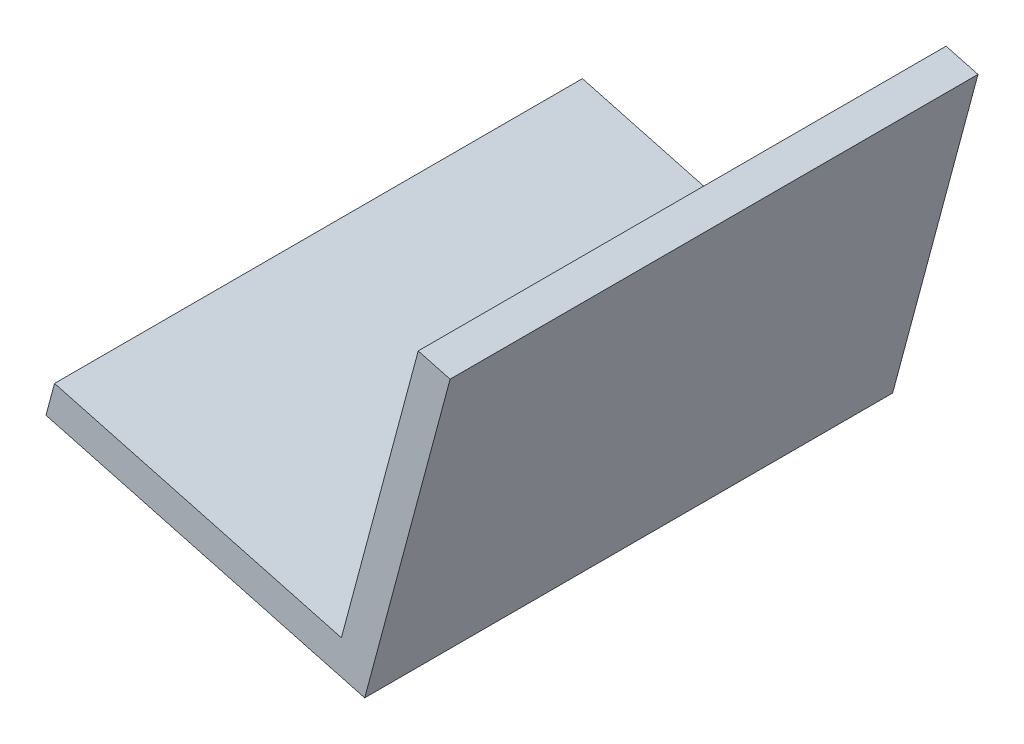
from build123d import *

# Parameters (mm, degrees)
BASE_EXTRUSION_DEPTH = 80


with BuildPart() as part:
    # Esquisse1 → Base-Extrusion (new body)
    with BuildSketch(Plane.XY):
        Polygon((3667.992295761, 3525.27902457), (3672.821924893, 3523.984929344), (3659.880972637, 3475.68863803), (3611.584681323, 3488.629590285), (3612.878776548, 3493.459219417), (3656.345438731, 3481.812362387), align=None)
    extrude(amount=-BASE_EXTRUSION_DEPTH)


solid = part.part
